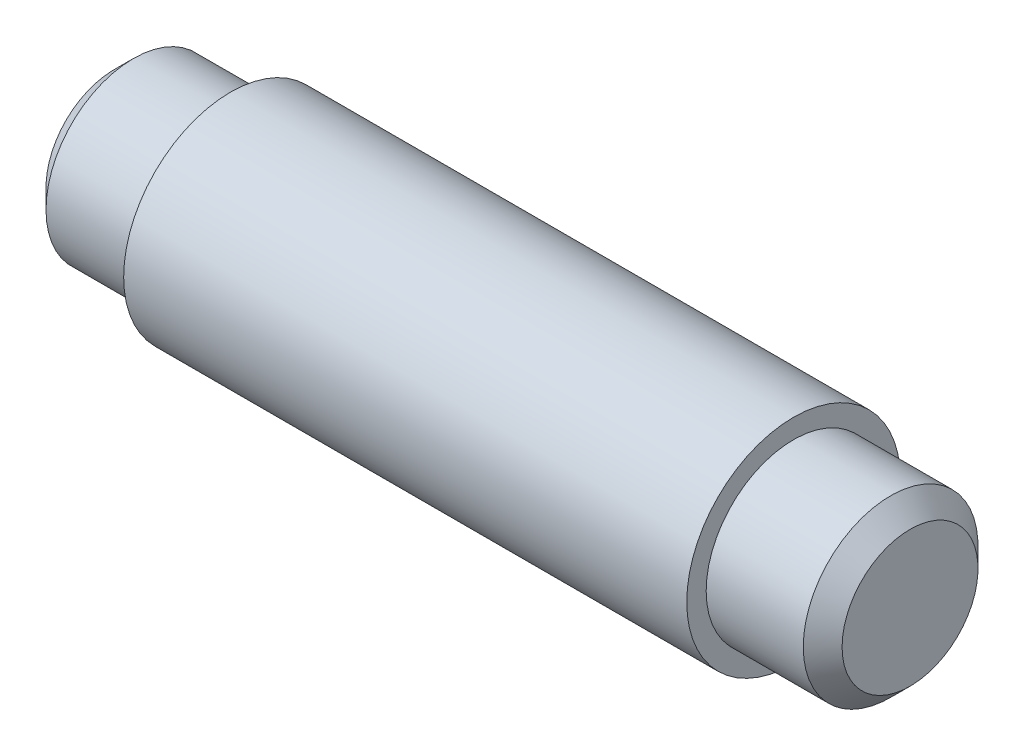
ISO-10303-21;
HEADER;
FILE_DESCRIPTION(('STEP AP214'),'2;1');
FILE_NAME('part.step','',(''),(''),'','','');
FILE_SCHEMA(('AUTOMOTIVE_DESIGN { 1 0 10303 214 1 1 1 1 }'));
ENDSEC;
DATA;
#1=APPLICATION_CONTEXT('core data for automotive mechanical design processes');
#2=APPLICATION_PROTOCOL_DEFINITION('international standard','automotive_design',2000,#1);
#3=PRODUCT_CONTEXT('',#1,'mechanical');
#4=PRODUCT('Part','Part','',(#3));
#5=PRODUCT_RELATED_PRODUCT_CATEGORY('part','',(#4));
#6=PRODUCT_DEFINITION_FORMATION('','',#4);
#7=PRODUCT_DEFINITION_CONTEXT('part definition',#1,'design');
#8=PRODUCT_DEFINITION('design','',#6,#7);
#9=PRODUCT_DEFINITION_SHAPE('','',#8);
#10=(LENGTH_UNIT() NAMED_UNIT(*) SI_UNIT(.MILLI.,.METRE.));
#11=(NAMED_UNIT(*) PLANE_ANGLE_UNIT() SI_UNIT($,.RADIAN.));
#12=(NAMED_UNIT(*) SI_UNIT($,.STERADIAN.) SOLID_ANGLE_UNIT());
#13=UNCERTAINTY_MEASURE_WITH_UNIT(LENGTH_MEASURE(1.E-05),#10,'distance_accuracy_value','');
#14=(GEOMETRIC_REPRESENTATION_CONTEXT(3) GLOBAL_UNCERTAINTY_ASSIGNED_CONTEXT((#13)) GLOBAL_UNIT_ASSIGNED_CONTEXT((#10,
#11,#12)) REPRESENTATION_CONTEXT('',''));
#15=CARTESIAN_POINT('',(0.,0.,0.));
#16=DIRECTION('',(0.,0.,1.));
#17=DIRECTION('',(1.,0.,0.));
#18=AXIS2_PLACEMENT_3D('',#15,#16,#17);
#19=CARTESIAN_POINT('',(-41.,9.,0.));
#20=DIRECTION('',(1.,0.,0.));
#21=DIRECTION('',(0.,0.,-1.));
#22=AXIS2_PLACEMENT_3D('',#19,#20,#21);
#23=PLANE('',#22);
#24=CARTESIAN_POINT('',(-41.,0.,0.));
#25=DIRECTION('',(1.,0.,0.));
#26=DIRECTION('',(0.,0.,-1.));
#27=AXIS2_PLACEMENT_3D('',#24,#25,#26);
#28=CIRCLE('',#27,6.99999999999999);
#29=CARTESIAN_POINT('',(-41.,0.,-6.99999999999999));
#30=VERTEX_POINT('',#29);
#31=EDGE_CURVE('E38',#30,#30,#28,.F.);
#32=ORIENTED_EDGE('',*,*,#31,.T.);
#33=EDGE_LOOP('',(#32));
#34=FACE_BOUND('',#33,.T.);
#35=ADVANCED_FACE('F31',(#34),#23,.F.);
#36=CARTESIAN_POINT('',(41.,0.,0.));
#37=DIRECTION('',(-1.,0.,0.));
#38=DIRECTION('',(0.,0.,1.));
#39=AXIS2_PLACEMENT_3D('',#36,#37,#38);
#40=PLANE('',#39);
#41=CARTESIAN_POINT('',(41.,0.,0.));
#42=DIRECTION('',(-1.,0.,0.));
#43=DIRECTION('',(0.,0.,1.));
#44=AXIS2_PLACEMENT_3D('',#41,#42,#43);
#45=CIRCLE('',#44,7.00000000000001);
#46=CARTESIAN_POINT('',(41.,0.,7.00000000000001));
#47=VERTEX_POINT('',#46);
#48=EDGE_CURVE('E42',#47,#47,#45,.F.);
#49=ORIENTED_EDGE('',*,*,#48,.T.);
#50=EDGE_LOOP('',(#49));
#51=FACE_BOUND('',#50,.T.);
#52=ADVANCED_FACE('F86',(#51),#40,.F.);
#53=CARTESIAN_POINT('',(-41.,0.,0.));
#54=DIRECTION('',(-1.,0.,0.));
#55=DIRECTION('',(0.,0.,1.));
#56=AXIS2_PLACEMENT_3D('',#53,#54,#55);
#57=CYLINDRICAL_SURFACE('',#56,8.99999999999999);
#58=CARTESIAN_POINT('',(39.,0.,0.));
#59=DIRECTION('',(-1.,0.,0.));
#60=DIRECTION('',(0.,0.,1.));
#61=AXIS2_PLACEMENT_3D('',#58,#59,#60);
#62=CIRCLE('',#61,8.99999999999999);
#63=CARTESIAN_POINT('',(39.,0.,8.99999999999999));
#64=VERTEX_POINT('',#63);
#65=EDGE_CURVE('E46',#64,#64,#62,.T.);
#66=ORIENTED_EDGE('',*,*,#65,.T.);
#67=EDGE_LOOP('',(#66));
#68=FACE_BOUND('',#67,.T.);
#69=CARTESIAN_POINT('',(29.,0.,0.));
#70=DIRECTION('',(-1.,0.,0.));
#71=DIRECTION('',(0.,0.,1.));
#72=AXIS2_PLACEMENT_3D('',#69,#70,#71);
#73=CIRCLE('',#72,8.99999999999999);
#74=CARTESIAN_POINT('',(29.,0.,8.99999999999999));
#75=VERTEX_POINT('',#74);
#76=EDGE_CURVE('E51',#75,#75,#73,.T.);
#77=ORIENTED_EDGE('',*,*,#76,.F.);
#78=EDGE_LOOP('',(#77));
#79=FACE_BOUND('',#78,.T.);
#80=ADVANCED_FACE('F81',(#68,#79),#57,.T.);
#81=CARTESIAN_POINT('',(29.,8.99999999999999,0.));
#82=DIRECTION('',(-1.,0.,0.));
#83=DIRECTION('',(0.,0.,1.));
#84=AXIS2_PLACEMENT_3D('',#81,#82,#83);
#85=PLANE('',#84);
#86=CARTESIAN_POINT('',(29.,0.,0.));
#87=DIRECTION('',(-1.,0.,0.));
#88=DIRECTION('',(0.,0.,1.));
#89=AXIS2_PLACEMENT_3D('',#86,#87,#88);
#90=CIRCLE('',#89,11.);
#91=CARTESIAN_POINT('',(29.,0.,11.));
#92=VERTEX_POINT('',#91);
#93=EDGE_CURVE('E54',#92,#92,#90,.T.);
#94=ORIENTED_EDGE('',*,*,#93,.F.);
#95=EDGE_LOOP('',(#94));
#96=FACE_BOUND('',#95,.T.);
#97=ORIENTED_EDGE('',*,*,#76,.T.);
#98=EDGE_LOOP('',(#97));
#99=FACE_BOUND('',#98,.T.);
#100=ADVANCED_FACE('F75',(#96,#99),#85,.F.);
#101=CARTESIAN_POINT('',(-41.,0.,0.));
#102=DIRECTION('',(-1.,0.,0.));
#103=DIRECTION('',(0.,0.,1.));
#104=AXIS2_PLACEMENT_3D('',#101,#102,#103);
#105=CYLINDRICAL_SURFACE('',#104,11.);
#106=CARTESIAN_POINT('',(-29.,0.,0.));
#107=DIRECTION('',(-1.,0.,0.));
#108=DIRECTION('',(0.,0.,1.));
#109=AXIS2_PLACEMENT_3D('',#106,#107,#108);
#110=CIRCLE('',#109,11.);
#111=CARTESIAN_POINT('',(-29.,0.,11.));
#112=VERTEX_POINT('',#111);
#113=EDGE_CURVE('E57',#112,#112,#110,.T.);
#114=ORIENTED_EDGE('',*,*,#113,.F.);
#115=EDGE_LOOP('',(#114));
#116=FACE_BOUND('',#115,.T.);
#117=ORIENTED_EDGE('',*,*,#93,.T.);
#118=EDGE_LOOP('',(#117));
#119=FACE_BOUND('',#118,.T.);
#120=ADVANCED_FACE('F69',(#116,#119),#105,.T.);
#121=CARTESIAN_POINT('',(-29.,11.,0.));
#122=DIRECTION('',(1.,0.,0.));
#123=DIRECTION('',(0.,0.,-1.));
#124=AXIS2_PLACEMENT_3D('',#121,#122,#123);
#125=PLANE('',#124);
#126=CARTESIAN_POINT('',(-29.,0.,0.));
#127=DIRECTION('',(-1.,0.,0.));
#128=DIRECTION('',(0.,0.,1.));
#129=AXIS2_PLACEMENT_3D('',#126,#127,#128);
#130=CIRCLE('',#129,8.99999999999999);
#131=CARTESIAN_POINT('',(-29.,0.,8.99999999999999));
#132=VERTEX_POINT('',#131);
#133=EDGE_CURVE('E60',#132,#132,#130,.T.);
#134=ORIENTED_EDGE('',*,*,#133,.F.);
#135=EDGE_LOOP('',(#134));
#136=FACE_BOUND('',#135,.T.);
#137=ORIENTED_EDGE('',*,*,#113,.T.);
#138=EDGE_LOOP('',(#137));
#139=FACE_BOUND('',#138,.T.);
#140=ADVANCED_FACE('F66',(#136,#139),#125,.F.);
#141=CARTESIAN_POINT('',(-41.,0.,0.));
#142=DIRECTION('',(-1.,0.,0.));
#143=DIRECTION('',(0.,0.,1.));
#144=AXIS2_PLACEMENT_3D('',#141,#142,#143);
#145=CYLINDRICAL_SURFACE('',#144,8.99999999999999);
#146=CARTESIAN_POINT('',(-39.,0.,0.));
#147=DIRECTION('',(1.,0.,0.));
#148=DIRECTION('',(0.,0.,-1.));
#149=AXIS2_PLACEMENT_3D('',#146,#147,#148);
#150=CIRCLE('',#149,8.99999999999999);
#151=CARTESIAN_POINT('',(-39.,0.,-8.99999999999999));
#152=VERTEX_POINT('',#151);
#153=EDGE_CURVE('E10',#152,#152,#150,.T.);
#154=ORIENTED_EDGE('',*,*,#153,.T.);
#155=EDGE_LOOP('',(#154));
#156=FACE_BOUND('',#155,.T.);
#157=ORIENTED_EDGE('',*,*,#133,.T.);
#158=EDGE_LOOP('',(#157));
#159=FACE_BOUND('',#158,.T.);
#160=ADVANCED_FACE('F64',(#156,#159),#145,.T.);
#161=CARTESIAN_POINT('',(39.,0.,0.));
#162=DIRECTION('',(-1.,0.,0.));
#163=DIRECTION('',(0.,0.,1.));
#164=AXIS2_PLACEMENT_3D('',#161,#162,#163);
#165=CONICAL_SURFACE('',#164,8.99999999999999,0.785398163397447);
#166=ORIENTED_EDGE('',*,*,#48,.F.);
#167=EDGE_LOOP('',(#166));
#168=FACE_BOUND('',#167,.T.);
#169=ORIENTED_EDGE('',*,*,#65,.F.);
#170=EDGE_LOOP('',(#169));
#171=FACE_BOUND('',#170,.T.);
#172=ADVANCED_FACE('F98',(#168,#171),#165,.T.);
#173=CARTESIAN_POINT('',(-41.,0.,0.));
#174=DIRECTION('',(1.,0.,0.));
#175=DIRECTION('',(0.,0.,-1.));
#176=AXIS2_PLACEMENT_3D('',#173,#174,#175);
#177=CONICAL_SURFACE('',#176,6.99999999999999,0.785398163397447);
#178=ORIENTED_EDGE('',*,*,#153,.F.);
#179=EDGE_LOOP('',(#178));
#180=FACE_BOUND('',#179,.T.);
#181=ORIENTED_EDGE('',*,*,#31,.F.);
#182=EDGE_LOOP('',(#181));
#183=FACE_BOUND('',#182,.T.);
#184=ADVANCED_FACE('F33',(#180,#183),#177,.T.);
#185=CLOSED_SHELL('',(#35,#52,#80,#100,#120,#140,#160,#172,#184));
#186=MANIFOLD_SOLID_BREP('B2',#185);
#187=ADVANCED_BREP_SHAPE_REPRESENTATION('',(#18,#186),#14);
#188=SHAPE_DEFINITION_REPRESENTATION(#9,#187);
ENDSEC;
END-ISO-10303-21;
